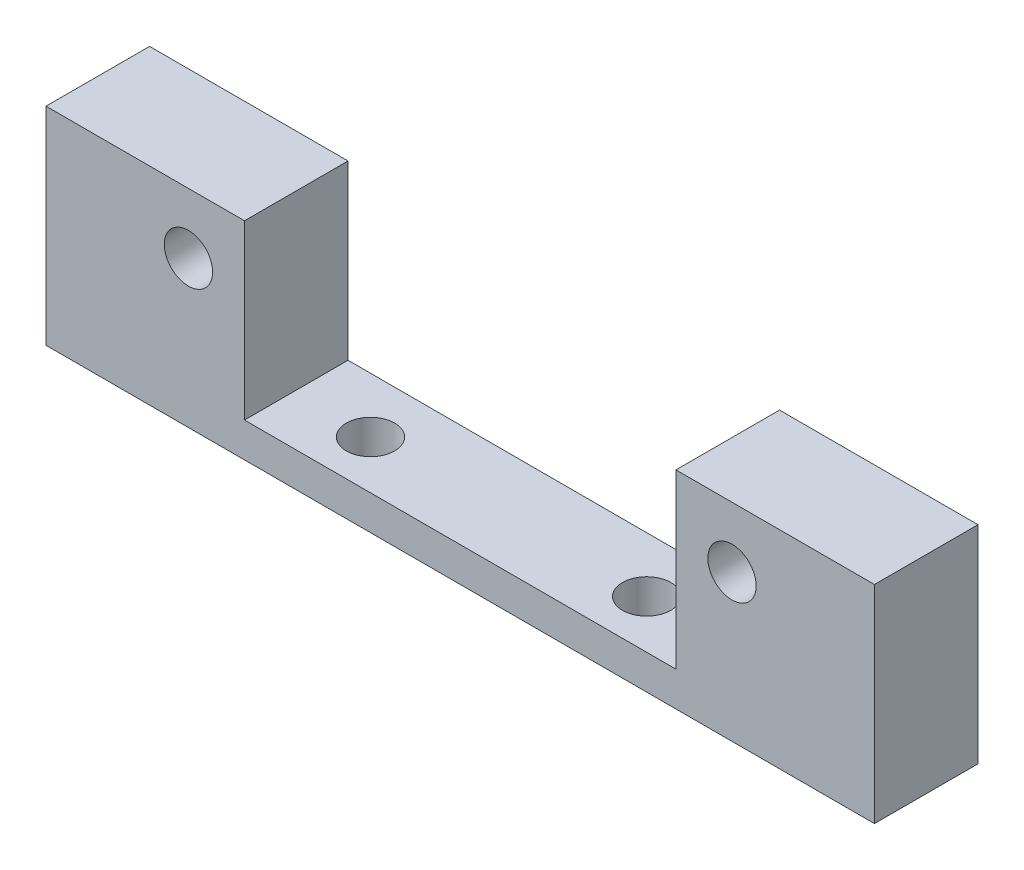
from build123d import *

# Parameters (mm, degrees)
SKETCH1_W           = 152.4
SKETCH1_H           = 19.05
BOSS_EXTRUDE1_DEPTH = 38.1
SKETCH2_R           = 4.445
CUT_EXTRUDE1_DEPTH  = 87.135590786
SKETCH3_R           = 4.445
CUT_EXTRUDE2_DEPTH  = 38.1
SKETCH4_W           = 79.375
SKETCH4_H           = 31.75
CUT_EXTRUDE3_DEPTH  = 88.298066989


with BuildPart() as part:
    # Sketch1 → Boss-Extrude1 (new body)
    with BuildSketch(Plane(origin=(0, 0, 0), x_dir=(1, 0, 0), z_dir=(0, 1, 0))):
        with Locations((0, 3.175)):
            Rectangle(SKETCH1_W, SKETCH1_H)
    extrude(amount=-BOSS_EXTRUDE1_DEPTH)

    # Sketch2 → Cut-Extrude1 (cut, through all)
    with BuildSketch(Plane(origin=(0, 0, 0), x_dir=(1, 0, 0), z_dir=(0, 1, 0))):
        with Locations(Location((-25.4, 2.54, 0), (0, 0, 270))):
            Circle(SKETCH2_R)
        with Locations(Location((25.4, 2.54, 0), (0, 0, 270))):
            Circle(SKETCH2_R)
    extrude(amount=-CUT_EXTRUDE1_DEPTH, mode=Mode.SUBTRACT)

    # Sketch3 → Cut-Extrude2 (cut)
    with BuildSketch(Plane.XY.offset(6.35)):
        with Locations((-49.9999, -11.1252)):
            Circle(SKETCH3_R)
        with Locations((49.9999, -11.1252)):
            Circle(SKETCH3_R)
    extrude(amount=-CUT_EXTRUDE2_DEPTH, mode=Mode.SUBTRACT)

    # Sketch4 → Cut-Extrude3 (cut, through all)
    with BuildSketch(Plane.XY.offset(6.35)):
        with Locations((0, -15.875)):
            Rectangle(SKETCH4_W, SKETCH4_H)
    extrude(amount=-CUT_EXTRUDE3_DEPTH, mode=Mode.SUBTRACT)


solid = part.part
